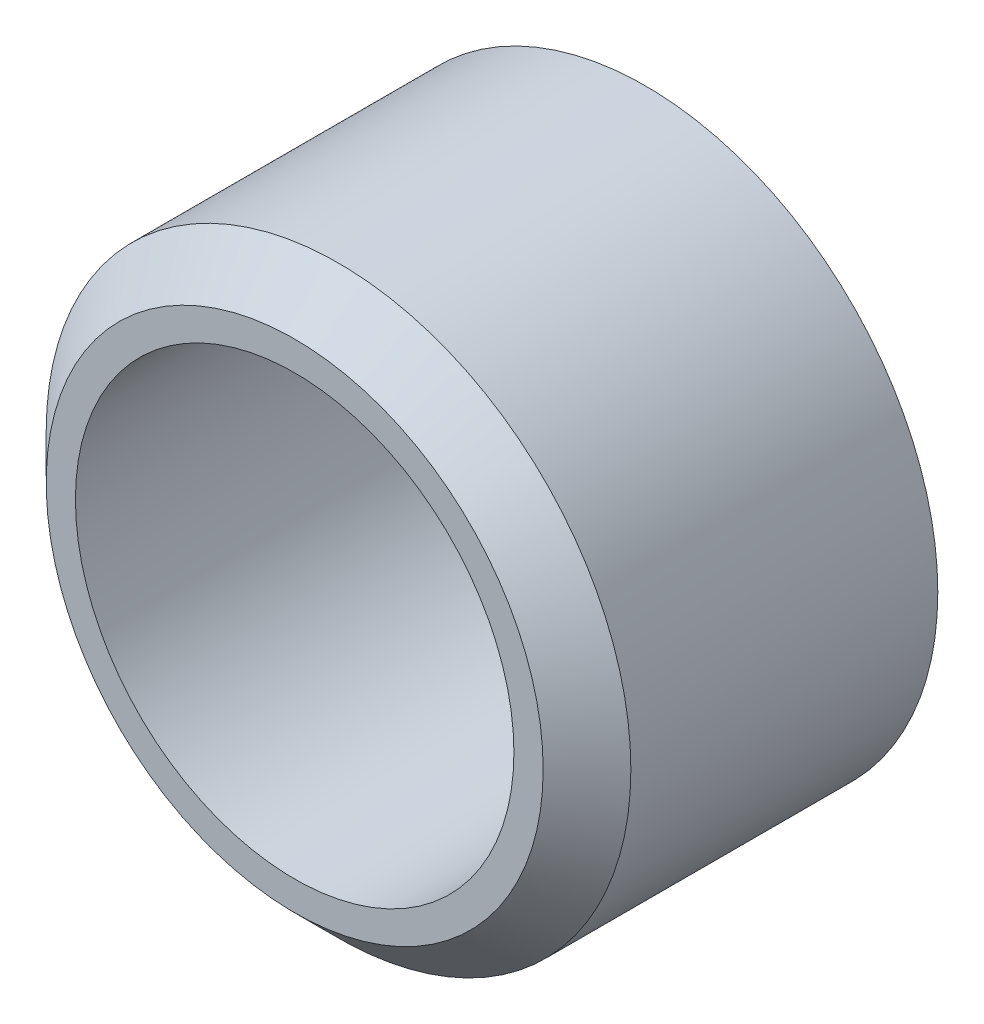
from build123d import *

# Parameters (mm, degrees)
SKETCH_1_R      = 20
SKETCH_1_R_2    = 15
EXTRUDE_1_DEPTH = 24
CHAMFER_1_SIZE  = 3


with BuildPart() as part:
    # Sketch 1 → Extrude 1 (new body)
    with BuildSketch(Plane.XY):
        Circle(SKETCH_1_R)
        Circle(SKETCH_1_R_2, mode=Mode.SUBTRACT)
    extrude(amount=EXTRUDE_1_DEPTH)

    # Chamfer 1
    chamfer_1_edges = [part.edges().sort_by_distance(p)[0] for p in [
        (-20, 0, 24),
    ]]
    chamfer(chamfer_1_edges, length=CHAMFER_1_SIZE)


solid = part.part
